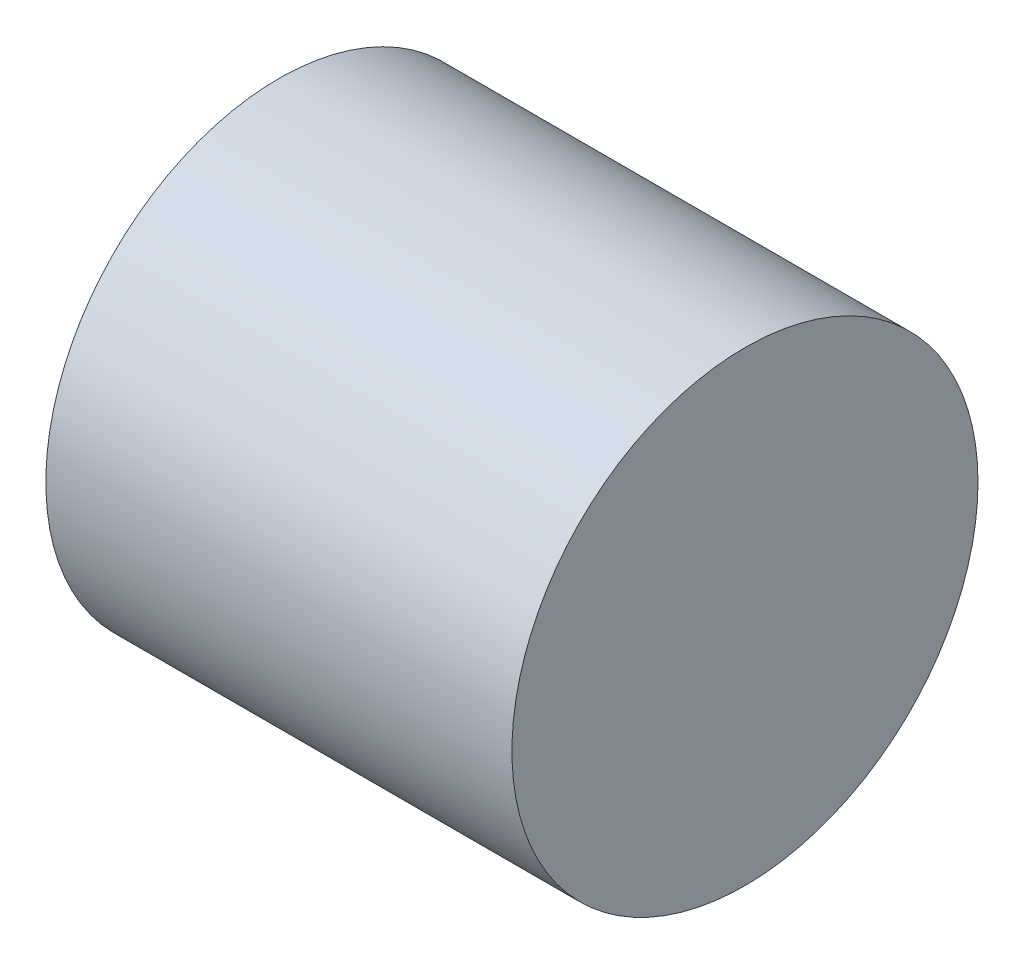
from build123d import *

# Parameters (mm, degrees)
SKETCH1_R           = 10
BOSS_EXTRUDE1_DEPTH = 20
CUT_EXTRUDE1_DEPTH  = 10


with BuildPart() as part:
    # Sketch1 → Boss-Extrude1 (new body)
    with BuildSketch(Plane(origin=(0, 0, 0), x_dir=(0, 0, -1), z_dir=(1, 0, 0))):
        Circle(SKETCH1_R)
    extrude(amount=BOSS_EXTRUDE1_DEPTH)

    # Sketch2 → Cut-Extrude1 (cut)
    with BuildSketch(Plane.ZY):
        with BuildLine():
            Line((-2.236067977, 2), (2.236067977, 2))
            ThreePointArc((2.236067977, 2), (0, -3), (-2.236067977, 2))
        make_face()
    extrude(amount=-CUT_EXTRUDE1_DEPTH, mode=Mode.SUBTRACT)


solid = part.part
